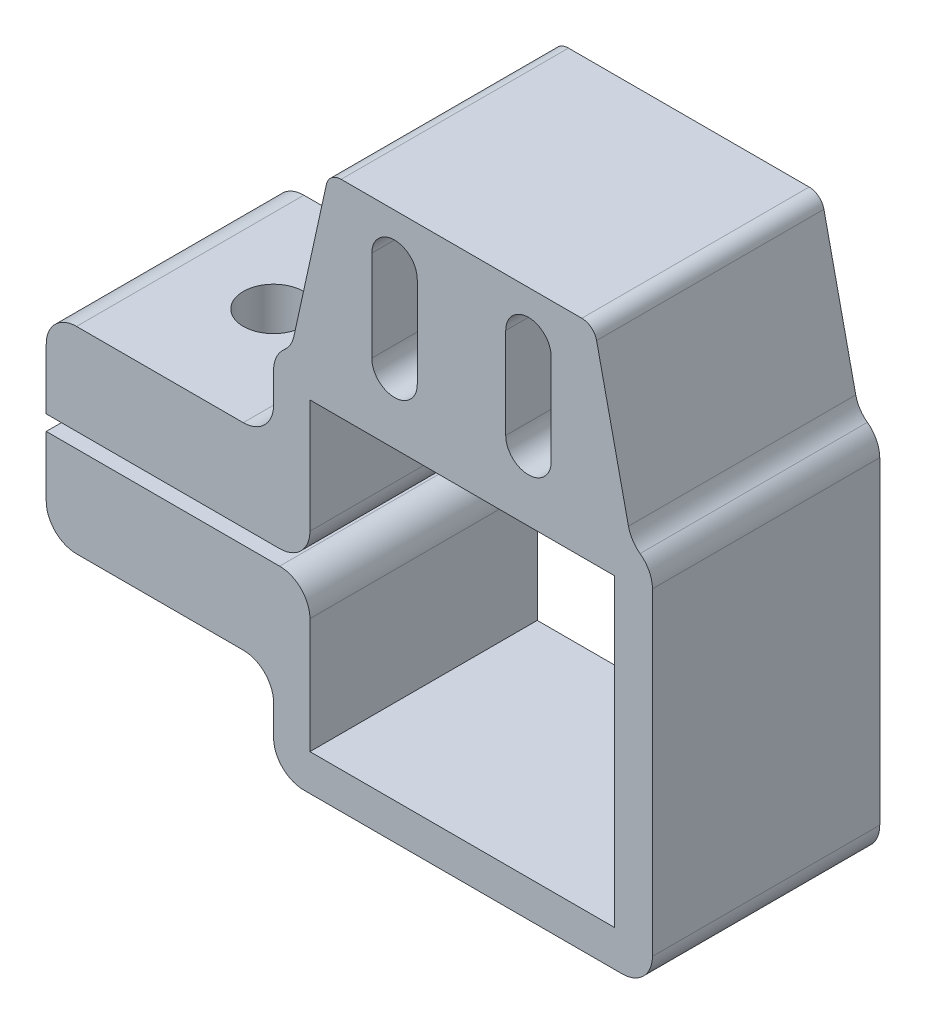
from build123d import *

# Parameters (mm, degrees)
BOSS_EXTRUDE1_DEPTH = 15
SKETCH2_R           = 2
CUT_EXTRUDE1_DEPTH  = 15


with BuildPart() as part:
    # Sketch1 → Boss-Extrude1 (new body)
    with BuildSketch(Plane.XY):
        with BuildLine():
            Line((217.342156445, -7.401419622), (237.442156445, -7.401419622))
            Line((237.442156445, -7.401419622), (237.442156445, 12.698580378))
            Line((237.442156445, 12.698580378), (217.342156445, 12.698580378))
            Line((217.342156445, 12.698580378), (217.342156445, 5.198580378))
            ThreePointArc((217.342156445, 5.198580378), (216.756370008, 3.784366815), (215.342156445, 3.198580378))
            Line((215.342156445, 3.198580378), (214.942156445, 3.198580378))
            Line((214.942156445, 3.198580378), (199.942156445, 3.199016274))
            Line((199.942156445, 3.199016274), (199.942156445, 7.198580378))
            ThreePointArc((199.942156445, 7.198580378), (200.527942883, 8.61279394), (201.942156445, 9.198580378))
            Line((201.942156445, 9.198580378), (212.942156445, 9.198580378))
            ThreePointArc((212.942156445, 9.198580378), (214.356370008, 9.784366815), (214.942156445, 11.198580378))
            Line((214.942156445, 11.198580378), (214.942156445, 13.198580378))
            ThreePointArc((214.942156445, 13.198580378), (215.123810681, 14.031418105), (215.635775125, 14.712967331))
            ThreePointArc((215.635775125, 14.712967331), (216.047217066, 15.203106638), (216.282787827, 15.798108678))
            Line((216.282787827, 15.798108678), (218.425731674, 25.550133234))
            ThreePointArc((218.425731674, 25.550133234), (218.775779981, 26.114812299), (219.402428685, 26.335510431))
            Line((219.402428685, 26.335510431), (235.281884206, 26.335510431))
            ThreePointArc((235.281884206, 26.335510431), (235.90853291, 26.114812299), (236.258581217, 25.550133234))
            Line((236.258581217, 25.550133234), (238.359049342, 15.991405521))
            ThreePointArc((238.359049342, 15.991405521), (238.63561268, 15.330587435), (239.127299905, 14.809615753))
            ThreePointArc((239.127299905, 14.809615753), (239.726853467, 14.101274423), (239.942156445, 13.198580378))
            Line((239.942156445, 13.198580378), (239.942156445, -7.801419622))
            ThreePointArc((239.942156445, -7.801419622), (239.356370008, -9.215633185), (237.942156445, -9.801419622))
            Line((237.942156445, -9.801419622), (216.942156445, -9.801419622))
            ThreePointArc((216.942156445, -9.801419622), (215.527942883, -9.215633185), (214.942156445, -7.801419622))
            Line((214.942156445, -7.801419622), (214.942156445, -5.801419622))
            ThreePointArc((214.942156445, -5.801419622), (214.356370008, -4.38720606), (212.942156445, -3.801419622))
            Line((212.942156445, -3.801419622), (201.942156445, -3.801419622))
            ThreePointArc((201.942156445, -3.801419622), (200.527942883, -3.215633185), (199.942156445, -1.801419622))
            Line((199.942156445, -1.801419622), (199.942156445, 2.198580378))
            Line((199.942156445, 2.198580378), (214.942156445, 2.198580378))
            Line((214.942156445, 2.198580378), (215.342156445, 2.198580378))
            ThreePointArc((215.342156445, 2.198580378), (216.756370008, 1.61279394), (217.342156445, 0.198580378))
            Line((217.342156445, 0.198580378), (217.342156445, -7.401419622))
        make_face()
        with BuildLine():
            Line((224.42352136, 23.126485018), (224.42352136, 17.126485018))
            ThreePointArc((224.42352136, 17.126485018), (222.92352136, 15.626485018), (221.42352136, 17.126485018))
            Line((221.42352136, 17.126485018), (221.42352136, 23.126485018))
            ThreePointArc((221.42352136, 23.126485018), (222.92352136, 24.626485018), (224.42352136, 23.126485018))
        make_face(mode=Mode.SUBTRACT)
        with BuildLine():
            Line((230.260791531, 23.126485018), (230.260791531, 17.126485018))
            ThreePointArc((230.260791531, 17.126485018), (231.760791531, 15.626485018), (233.260791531, 17.126485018))
            Line((233.260791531, 17.126485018), (233.260791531, 23.126485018))
            ThreePointArc((233.260791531, 23.126485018), (231.760791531, 24.626485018), (230.260791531, 23.126485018))
        make_face(mode=Mode.SUBTRACT)
    extrude(amount=BOSS_EXTRUDE1_DEPTH)

    # Sketch2 → Cut-Extrude1 (cut)
    with BuildSketch(Plane(origin=(0, 9.198580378, 0), x_dir=(-1, 0, 0), z_dir=(0, 1, 0))):
        with Locations(Location((-207.442156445, 7.5, 0), (0, 0, 90))):
            Circle(SKETCH2_R)
    extrude(amount=-CUT_EXTRUDE1_DEPTH, mode=Mode.SUBTRACT)


solid = part.part
